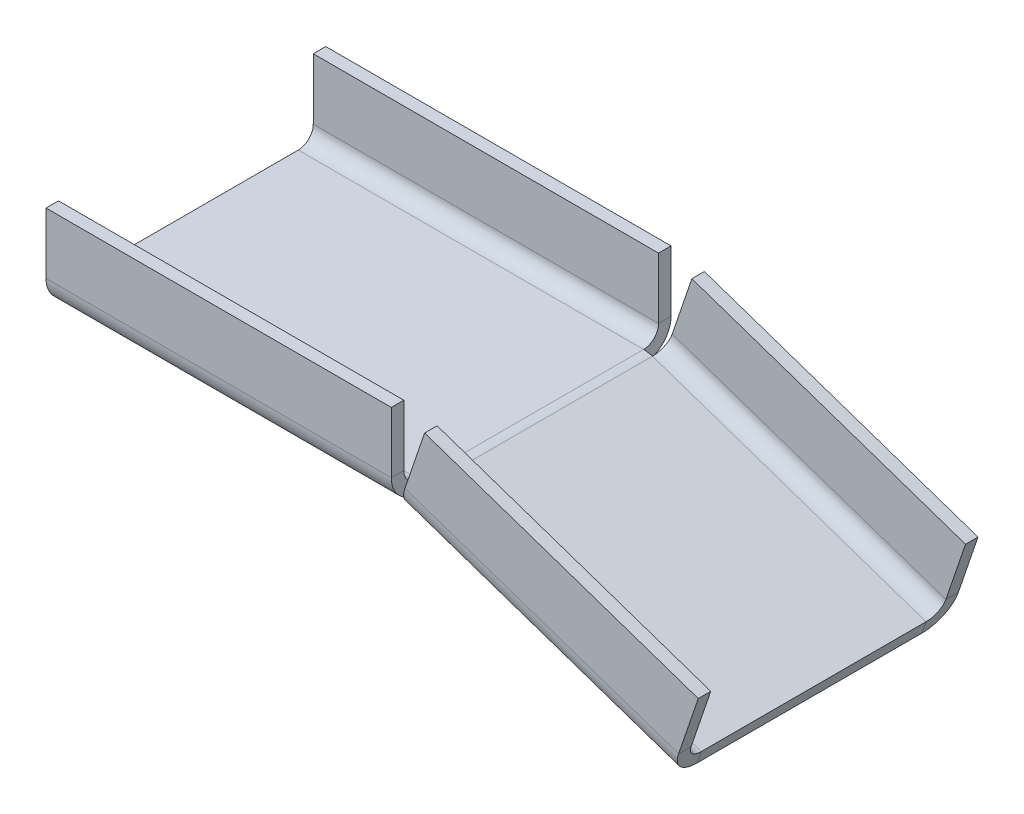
ISO-10303-21;
HEADER;
FILE_DESCRIPTION(('STEP AP214'),'2;1');
FILE_NAME('part.step','',(''),(''),'','','');
FILE_SCHEMA(('AUTOMOTIVE_DESIGN { 1 0 10303 214 1 1 1 1 }'));
ENDSEC;
DATA;
#1=APPLICATION_CONTEXT('core data for automotive mechanical design processes');
#2=APPLICATION_PROTOCOL_DEFINITION('international standard','automotive_design',2000,#1);
#3=PRODUCT_CONTEXT('',#1,'mechanical');
#4=PRODUCT('Part','Part','',(#3));
#5=PRODUCT_RELATED_PRODUCT_CATEGORY('part','',(#4));
#6=PRODUCT_DEFINITION_FORMATION('','',#4);
#7=PRODUCT_DEFINITION_CONTEXT('part definition',#1,'design');
#8=PRODUCT_DEFINITION('design','',#6,#7);
#9=PRODUCT_DEFINITION_SHAPE('','',#8);
#10=(LENGTH_UNIT() NAMED_UNIT(*) SI_UNIT(.MILLI.,.METRE.));
#11=(NAMED_UNIT(*) PLANE_ANGLE_UNIT() SI_UNIT($,.RADIAN.));
#12=(NAMED_UNIT(*) SI_UNIT($,.STERADIAN.) SOLID_ANGLE_UNIT());
#13=UNCERTAINTY_MEASURE_WITH_UNIT(LENGTH_MEASURE(1.E-05),#10,'distance_accuracy_value','');
#14=(GEOMETRIC_REPRESENTATION_CONTEXT(3) GLOBAL_UNCERTAINTY_ASSIGNED_CONTEXT((#13)) GLOBAL_UNIT_ASSIGNED_CONTEXT((#10,
#11,#12)) REPRESENTATION_CONTEXT('',''));
#15=CARTESIAN_POINT('',(0.,0.,0.));
#16=DIRECTION('',(0.,0.,1.));
#17=DIRECTION('',(1.,0.,0.));
#18=AXIS2_PLACEMENT_3D('',#15,#16,#17);
#19=CARTESIAN_POINT('',(1.72352764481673,-0.586592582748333,45.));
#20=DIRECTION('',(0.,0.,1.));
#21=DIRECTION('',(1.,0.,0.));
#22=AXIS2_PLACEMENT_3D('',#19,#20,#21);
#23=PLANE('',#22);
#24=DIRECTION('',(-0.322194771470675,-0.946673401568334,0.));
#25=VECTOR('',#24,1.);
#26=CARTESIAN_POINT('',(1.72352764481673,-0.586592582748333,45.));
#27=LINE('',#26,#25);
#28=CARTESIAN_POINT('',(1.72352764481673,-0.586592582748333,45.));
#29=VERTEX_POINT('',#28);
#30=CARTESIAN_POINT('',(0.112553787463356,-5.31995959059,45.));
#31=VERTEX_POINT('',#30);
#32=EDGE_CURVE('E11',#29,#31,#27,.T.);
#33=ORIENTED_EDGE('',*,*,#32,.F.);
#34=CARTESIAN_POINT('',(-1.8206148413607,-11.,45.));
#35=DIRECTION('',(0.,0.,1.));
#36=DIRECTION('',(1.,0.,0.));
#37=AXIS2_PLACEMENT_3D('',#34,#35,#36);
#38=CIRCLE('',#37,11.);
#39=CARTESIAN_POINT('',(-1.8206148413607,0.,45.));
#40=VERTEX_POINT('',#39);
#41=EDGE_CURVE('E398',#40,#29,#38,.F.);
#42=ORIENTED_EDGE('',*,*,#41,.F.);
#43=DIRECTION('',(0.,1.,0.));
#44=VECTOR('',#43,1.);
#45=CARTESIAN_POINT('',(-1.8206148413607,-5.,45.));
#46=LINE('',#45,#44);
#47=CARTESIAN_POINT('',(-1.82061484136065,-5.,45.));
#48=VERTEX_POINT('',#47);
#49=EDGE_CURVE('E40',#48,#40,#46,.T.);
#50=ORIENTED_EDGE('',*,*,#49,.F.);
#51=CARTESIAN_POINT('',(-1.8206148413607,-11.,45.));
#52=DIRECTION('',(0.,0.,1.));
#53=DIRECTION('',(1.,0.,0.));
#54=AXIS2_PLACEMENT_3D('',#51,#52,#53);
#55=CIRCLE('',#54,6.);
#56=EDGE_CURVE('E409',#48,#31,#55,.F.);
#57=ORIENTED_EDGE('',*,*,#56,.T.);
#58=EDGE_LOOP('',(#33,#42,#50,#57));
#59=FACE_BOUND('',#58,.T.);
#60=ADVANCED_FACE('F33',(#59),#23,.T.);
#61=CARTESIAN_POINT('',(-1.8206148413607,0.,-45.));
#62=DIRECTION('',(0.,0.,-1.));
#63=DIRECTION('',(-1.,0.,0.));
#64=AXIS2_PLACEMENT_3D('',#61,#62,#63);
#65=PLANE('',#64);
#66=DIRECTION('',(0.,-1.,0.));
#67=VECTOR('',#66,1.);
#68=CARTESIAN_POINT('',(-1.8206148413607,0.,-45.));
#69=LINE('',#68,#67);
#70=CARTESIAN_POINT('',(-1.82061484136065,0.,-45.));
#71=VERTEX_POINT('',#70);
#72=CARTESIAN_POINT('',(-1.8206148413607,-5.,-45.));
#73=VERTEX_POINT('',#72);
#74=EDGE_CURVE('E435',#71,#73,#69,.T.);
#75=ORIENTED_EDGE('',*,*,#74,.F.);
#76=CARTESIAN_POINT('',(-1.8206148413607,-11.,-45.));
#77=DIRECTION('',(0.,0.,1.));
#78=DIRECTION('',(1.,0.,0.));
#79=AXIS2_PLACEMENT_3D('',#76,#77,#78);
#80=CIRCLE('',#79,11.);
#81=CARTESIAN_POINT('',(1.72352764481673,-0.586592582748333,-45.));
#82=VERTEX_POINT('',#81);
#83=EDGE_CURVE('E375',#71,#82,#80,.F.);
#84=ORIENTED_EDGE('',*,*,#83,.T.);
#85=DIRECTION('',(0.322194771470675,0.946673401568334,0.));
#86=VECTOR('',#85,1.);
#87=CARTESIAN_POINT('',(0.112553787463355,-5.31995959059,-45.));
#88=LINE('',#87,#86);
#89=CARTESIAN_POINT('',(0.112553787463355,-5.31995959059,-45.));
#90=VERTEX_POINT('',#89);
#91=EDGE_CURVE('E201',#90,#82,#88,.T.);
#92=ORIENTED_EDGE('',*,*,#91,.F.);
#93=CARTESIAN_POINT('',(-1.8206148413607,-11.,-45.));
#94=DIRECTION('',(0.,0.,1.));
#95=DIRECTION('',(1.,0.,0.));
#96=AXIS2_PLACEMENT_3D('',#93,#94,#95);
#97=CIRCLE('',#96,6.);
#98=EDGE_CURVE('E387',#73,#90,#97,.F.);
#99=ORIENTED_EDGE('',*,*,#98,.F.);
#100=EDGE_LOOP('',(#75,#84,#92,#99));
#101=FACE_BOUND('',#100,.T.);
#102=ADVANCED_FACE('F489',(#101),#65,.T.);
#103=CARTESIAN_POINT('',(-1.61097385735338,-4.73336700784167,45.));
#104=DIRECTION('',(0.322194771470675,0.946673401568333,0.));
#105=DIRECTION('',(-0.946673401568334,0.322194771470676,0.));
#106=AXIS2_PLACEMENT_3D('',#103,#104,#105);
#107=PLANE('',#106);
#108=DIRECTION('',(0.946673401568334,-0.322194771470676,0.));
#109=VECTOR('',#108,1.);
#110=CARTESIAN_POINT('',(-1.61097385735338,-4.73336700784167,-45.));
#111=LINE('',#110,#109);
#112=CARTESIAN_POINT('',(109.673244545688,-42.6083017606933,-45.));
#113=VERTEX_POINT('',#112);
#114=EDGE_CURVE('E365',#90,#113,#111,.T.);
#115=ORIENTED_EDGE('',*,*,#114,.T.);
#116=DIRECTION('',(0.,0.,-1.));
#117=VECTOR('',#116,1.);
#118=CARTESIAN_POINT('',(109.673244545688,-42.6083017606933,45.));
#119=LINE('',#118,#117);
#120=CARTESIAN_POINT('',(109.673244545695,-42.6083017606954,45.));
#121=VERTEX_POINT('',#120);
#122=EDGE_CURVE('E432',#121,#113,#119,.T.);
#123=ORIENTED_EDGE('',*,*,#122,.F.);
#124=DIRECTION('',(0.946673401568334,-0.322194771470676,0.));
#125=VECTOR('',#124,1.);
#126=CARTESIAN_POINT('',(-1.61097385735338,-4.73336700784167,45.));
#127=LINE('',#126,#125);
#128=EDGE_CURVE('E390',#31,#121,#127,.T.);
#129=ORIENTED_EDGE('',*,*,#128,.F.);
#130=DIRECTION('',(0.,0.,-1.));
#131=VECTOR('',#130,1.);
#132=CARTESIAN_POINT('',(0.112553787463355,-5.31995959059,45.));
#133=LINE('',#132,#131);
#134=EDGE_CURVE('E412',#31,#90,#133,.T.);
#135=ORIENTED_EDGE('',*,*,#134,.T.);
#136=EDGE_LOOP('',(#115,#123,#129,#135));
#137=FACE_BOUND('',#136,.T.);
#138=ADVANCED_FACE('F493',(#137),#107,.F.);
#139=CARTESIAN_POINT('',(111.284218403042,-37.8749347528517,45.));
#140=DIRECTION('',(0.946673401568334,-0.322194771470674,0.));
#141=DIRECTION('',(0.322194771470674,0.946673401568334,0.));
#142=AXIS2_PLACEMENT_3D('',#139,#140,#141);
#143=PLANE('',#142);
#144=DIRECTION('',(-0.322194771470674,-0.946673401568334,0.));
#145=VECTOR('',#144,1.);
#146=CARTESIAN_POINT('',(111.284218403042,-37.8749347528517,-45.));
#147=LINE('',#146,#145);
#148=CARTESIAN_POINT('',(111.284218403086,-37.8749347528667,-45.));
#149=VERTEX_POINT('',#148);
#150=EDGE_CURVE('E370',#149,#113,#147,.T.);
#151=ORIENTED_EDGE('',*,*,#150,.F.);
#152=DIRECTION('',(0.,0.,-1.));
#153=VECTOR('',#152,1.);
#154=CARTESIAN_POINT('',(111.284218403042,-37.8749347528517,45.));
#155=LINE('',#154,#153);
#156=CARTESIAN_POINT('',(111.284218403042,-37.8749347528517,45.));
#157=VERTEX_POINT('',#156);
#158=EDGE_CURVE('E429',#157,#149,#155,.T.);
#159=ORIENTED_EDGE('',*,*,#158,.F.);
#160=DIRECTION('',(-0.322194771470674,-0.946673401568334,0.));
#161=VECTOR('',#160,1.);
#162=CARTESIAN_POINT('',(111.284218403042,-37.8749347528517,45.));
#163=LINE('',#162,#161);
#164=EDGE_CURVE('E392',#157,#121,#163,.T.);
#165=ORIENTED_EDGE('',*,*,#164,.T.);
#166=ORIENTED_EDGE('',*,*,#122,.T.);
#167=EDGE_LOOP('',(#151,#159,#165,#166));
#168=FACE_BOUND('',#167,.T.);
#169=ADVANCED_FACE('F498',(#168),#143,.T.);
#170=CARTESIAN_POINT('',(0.,0.,45.));
#171=DIRECTION('',(0.322194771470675,0.946673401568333,0.));
#172=DIRECTION('',(-0.946673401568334,0.322194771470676,0.));
#173=AXIS2_PLACEMENT_3D('',#170,#171,#172);
#174=PLANE('',#173);
#175=DIRECTION('',(0.946673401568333,-0.322194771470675,0.));
#176=VECTOR('',#175,1.);
#177=CARTESIAN_POINT('',(0.,0.,-45.));
#178=LINE('',#177,#176);
#179=EDGE_CURVE('E373',#82,#149,#178,.T.);
#180=ORIENTED_EDGE('',*,*,#179,.F.);
#181=DIRECTION('',(0.,0.,-1.));
#182=VECTOR('',#181,1.);
#183=CARTESIAN_POINT('',(1.72352764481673,-0.586592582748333,45.));
#184=LINE('',#183,#182);
#185=EDGE_CURVE('E427',#29,#82,#184,.T.);
#186=ORIENTED_EDGE('',*,*,#185,.F.);
#187=DIRECTION('',(0.946673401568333,-0.322194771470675,0.));
#188=VECTOR('',#187,1.);
#189=CARTESIAN_POINT('',(0.,0.,45.));
#190=LINE('',#189,#188);
#191=EDGE_CURVE('E395',#29,#157,#190,.T.);
#192=ORIENTED_EDGE('',*,*,#191,.T.);
#193=ORIENTED_EDGE('',*,*,#158,.T.);
#194=EDGE_LOOP('',(#180,#186,#192,#193));
#195=FACE_BOUND('',#194,.T.);
#196=ADVANCED_FACE('F505',(#195),#174,.T.);
#197=CARTESIAN_POINT('',(-1.8206148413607,-11.,45.));
#198=DIRECTION('',(0.,0.,-1.));
#199=DIRECTION('',(-1.,0.,0.));
#200=AXIS2_PLACEMENT_3D('',#197,#198,#199);
#201=CYLINDRICAL_SURFACE('',#200,11.);
#202=ORIENTED_EDGE('',*,*,#83,.F.);
#203=DIRECTION('',(0.,0.,-1.));
#204=VECTOR('',#203,1.);
#205=CARTESIAN_POINT('',(-1.8206148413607,0.,45.));
#206=LINE('',#205,#204);
#207=EDGE_CURVE('E424',#40,#71,#206,.T.);
#208=ORIENTED_EDGE('',*,*,#207,.F.);
#209=ORIENTED_EDGE('',*,*,#41,.T.);
#210=ORIENTED_EDGE('',*,*,#185,.T.);
#211=EDGE_LOOP('',(#202,#208,#209,#210));
#212=FACE_BOUND('',#211,.T.);
#213=ADVANCED_FACE('F447',(#212),#201,.T.);
#214=CARTESIAN_POINT('',(0.,0.,45.));
#215=DIRECTION('',(0.,1.,0.));
#216=DIRECTION('',(0.,0.,1.));
#217=AXIS2_PLACEMENT_3D('',#214,#215,#216);
#218=PLANE('',#217);
#219=DIRECTION('',(1.,0.,0.));
#220=VECTOR('',#219,1.);
#221=CARTESIAN_POINT('',(0.,0.,-45.));
#222=LINE('',#221,#220);
#223=CARTESIAN_POINT('',(-140.068203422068,0.,-45.));
#224=VERTEX_POINT('',#223);
#225=EDGE_CURVE('E378',#224,#71,#222,.T.);
#226=ORIENTED_EDGE('',*,*,#225,.F.);
#227=DIRECTION('',(0.,0.,-1.));
#228=VECTOR('',#227,1.);
#229=CARTESIAN_POINT('',(-140.068203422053,0.,45.));
#230=LINE('',#229,#228);
#231=CARTESIAN_POINT('',(-140.068203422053,0.,45.));
#232=VERTEX_POINT('',#231);
#233=EDGE_CURVE('E421',#232,#224,#230,.T.);
#234=ORIENTED_EDGE('',*,*,#233,.F.);
#235=DIRECTION('',(1.,0.,0.));
#236=VECTOR('',#235,1.);
#237=CARTESIAN_POINT('',(0.,0.,45.));
#238=LINE('',#237,#236);
#239=EDGE_CURVE('E401',#232,#40,#238,.T.);
#240=ORIENTED_EDGE('',*,*,#239,.T.);
#241=ORIENTED_EDGE('',*,*,#207,.T.);
#242=EDGE_LOOP('',(#226,#234,#240,#241));
#243=FACE_BOUND('',#242,.T.);
#244=ADVANCED_FACE('F453',(#243),#218,.T.);
#245=CARTESIAN_POINT('',(-140.068203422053,-5.,45.));
#246=DIRECTION('',(-1.,0.,0.));
#247=DIRECTION('',(0.,0.,1.));
#248=AXIS2_PLACEMENT_3D('',#245,#246,#247);
#249=PLANE('',#248);
#250=DIRECTION('',(0.,1.,0.));
#251=VECTOR('',#250,1.);
#252=CARTESIAN_POINT('',(-140.068203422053,-5.,-45.));
#253=LINE('',#252,#251);
#254=CARTESIAN_POINT('',(-140.068203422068,-5.,-45.));
#255=VERTEX_POINT('',#254);
#256=EDGE_CURVE('E381',#255,#224,#253,.T.);
#257=ORIENTED_EDGE('',*,*,#256,.F.);
#258=DIRECTION('',(0.,0.,-1.));
#259=VECTOR('',#258,1.);
#260=CARTESIAN_POINT('',(-140.068203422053,-5.,45.));
#261=LINE('',#260,#259);
#262=CARTESIAN_POINT('',(-140.068203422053,-5.,45.));
#263=VERTEX_POINT('',#262);
#264=EDGE_CURVE('E418',#263,#255,#261,.T.);
#265=ORIENTED_EDGE('',*,*,#264,.F.);
#266=DIRECTION('',(0.,1.,0.));
#267=VECTOR('',#266,1.);
#268=CARTESIAN_POINT('',(-140.068203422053,-5.,45.));
#269=LINE('',#268,#267);
#270=EDGE_CURVE('E404',#263,#232,#269,.T.);
#271=ORIENTED_EDGE('',*,*,#270,.T.);
#272=ORIENTED_EDGE('',*,*,#233,.T.);
#273=EDGE_LOOP('',(#257,#265,#271,#272));
#274=FACE_BOUND('',#273,.T.);
#275=ADVANCED_FACE('F514',(#274),#249,.T.);
#276=CARTESIAN_POINT('',(0.,-5.,45.));
#277=DIRECTION('',(0.,1.,0.));
#278=DIRECTION('',(0.,0.,1.));
#279=AXIS2_PLACEMENT_3D('',#276,#277,#278);
#280=PLANE('',#279);
#281=DIRECTION('',(1.,0.,0.));
#282=VECTOR('',#281,1.);
#283=CARTESIAN_POINT('',(0.,-5.,-45.));
#284=LINE('',#283,#282);
#285=EDGE_CURVE('E384',#255,#73,#284,.T.);
#286=ORIENTED_EDGE('',*,*,#285,.T.);
#287=DIRECTION('',(0.,0.,-1.));
#288=VECTOR('',#287,1.);
#289=CARTESIAN_POINT('',(-1.8206148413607,-5.,45.));
#290=LINE('',#289,#288);
#291=EDGE_CURVE('E415',#48,#73,#290,.T.);
#292=ORIENTED_EDGE('',*,*,#291,.F.);
#293=DIRECTION('',(1.,0.,0.));
#294=VECTOR('',#293,1.);
#295=CARTESIAN_POINT('',(0.,-5.,45.));
#296=LINE('',#295,#294);
#297=EDGE_CURVE('E407',#263,#48,#296,.T.);
#298=ORIENTED_EDGE('',*,*,#297,.F.);
#299=ORIENTED_EDGE('',*,*,#264,.T.);
#300=EDGE_LOOP('',(#286,#292,#298,#299));
#301=FACE_BOUND('',#300,.T.);
#302=ADVANCED_FACE('F517',(#301),#280,.F.);
#303=CARTESIAN_POINT('',(-1.8206148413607,-11.,45.));
#304=DIRECTION('',(0.,0.,-1.));
#305=DIRECTION('',(-1.,0.,0.));
#306=AXIS2_PLACEMENT_3D('',#303,#304,#305);
#307=CYLINDRICAL_SURFACE('',#306,6.);
#308=ORIENTED_EDGE('',*,*,#98,.T.);
#309=ORIENTED_EDGE('',*,*,#134,.F.);
#310=ORIENTED_EDGE('',*,*,#56,.F.);
#311=ORIENTED_EDGE('',*,*,#291,.T.);
#312=EDGE_LOOP('',(#308,#309,#310,#311));
#313=FACE_BOUND('',#312,.T.);
#314=ADVANCED_FACE('F520',(#313),#307,.F.);
#315=CARTESIAN_POINT('',(-140.068203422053,30.3991962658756,51.));
#316=DIRECTION('',(0.,-1.,0.));
#317=DIRECTION('',(1.,0.,0.));
#318=AXIS2_PLACEMENT_3D('',#315,#316,#317);
#319=PLANE('',#318);
#320=DIRECTION('',(0.,0.,1.));
#321=VECTOR('',#320,1.);
#322=CARTESIAN_POINT('',(-1.8206148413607,30.3991962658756,51.));
#323=LINE('',#322,#321);
#324=CARTESIAN_POINT('',(-1.8206148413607,30.3991962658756,51.));
#325=VERTEX_POINT('',#324);
#326=CARTESIAN_POINT('',(-1.8206148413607,30.3991962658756,56.));
#327=VERTEX_POINT('',#326);
#328=EDGE_CURVE('E363',#325,#327,#323,.T.);
#329=ORIENTED_EDGE('',*,*,#328,.F.);
#330=DIRECTION('',(1.,0.,0.));
#331=VECTOR('',#330,1.);
#332=CARTESIAN_POINT('',(-140.068203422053,30.3991962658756,51.));
#333=LINE('',#332,#331);
#334=CARTESIAN_POINT('',(-140.068203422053,30.3991962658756,51.));
#335=VERTEX_POINT('',#334);
#336=EDGE_CURVE('E334',#335,#325,#333,.T.);
#337=ORIENTED_EDGE('',*,*,#336,.F.);
#338=DIRECTION('',(0.,0.,1.));
#339=VECTOR('',#338,1.);
#340=CARTESIAN_POINT('',(-140.068203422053,30.3991962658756,51.));
#341=LINE('',#340,#339);
#342=CARTESIAN_POINT('',(-140.068203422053,30.3991962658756,56.));
#343=VERTEX_POINT('',#342);
#344=EDGE_CURVE('E361',#335,#343,#341,.T.);
#345=ORIENTED_EDGE('',*,*,#344,.T.);
#346=DIRECTION('',(1.,0.,0.));
#347=VECTOR('',#346,1.);
#348=CARTESIAN_POINT('',(-140.068203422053,30.3991962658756,56.));
#349=LINE('',#348,#347);
#350=EDGE_CURVE('E345',#343,#327,#349,.T.);
#351=ORIENTED_EDGE('',*,*,#350,.T.);
#352=EDGE_LOOP('',(#329,#337,#345,#351));
#353=FACE_BOUND('',#352,.T.);
#354=ADVANCED_FACE('F469',(#353),#319,.F.);
#355=CARTESIAN_POINT('',(-140.068203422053,30.3991962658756,51.));
#356=DIRECTION('',(1.,0.,0.));
#357=DIRECTION('',(0.,1.,0.));
#358=AXIS2_PLACEMENT_3D('',#355,#356,#357);
#359=PLANE('',#358);
#360=ORIENTED_EDGE('',*,*,#344,.F.);
#361=DIRECTION('',(0.,1.,0.));
#362=VECTOR('',#361,1.);
#363=CARTESIAN_POINT('',(-140.068203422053,30.3991962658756,51.));
#364=LINE('',#363,#362);
#365=CARTESIAN_POINT('',(-140.068203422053,6.,51.));
#366=VERTEX_POINT('',#365);
#367=EDGE_CURVE('E338',#335,#366,#364,.F.);
#368=ORIENTED_EDGE('',*,*,#367,.T.);
#369=DIRECTION('',(0.,0.,1.));
#370=VECTOR('',#369,1.);
#371=CARTESIAN_POINT('',(-140.068203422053,6.,51.));
#372=LINE('',#371,#370);
#373=CARTESIAN_POINT('',(-140.068203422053,6.,56.));
#374=VERTEX_POINT('',#373);
#375=EDGE_CURVE('E358',#366,#374,#372,.T.);
#376=ORIENTED_EDGE('',*,*,#375,.T.);
#377=DIRECTION('',(0.,1.,0.));
#378=VECTOR('',#377,1.);
#379=CARTESIAN_POINT('',(-140.068203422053,30.3991962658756,56.));
#380=LINE('',#379,#378);
#381=EDGE_CURVE('E350',#343,#374,#380,.F.);
#382=ORIENTED_EDGE('',*,*,#381,.F.);
#383=EDGE_LOOP('',(#360,#368,#376,#382));
#384=FACE_BOUND('',#383,.T.);
#385=ADVANCED_FACE('F462',(#384),#359,.F.);
#386=CARTESIAN_POINT('',(-1.8206148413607,30.3991962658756,51.));
#387=DIRECTION('',(1.,0.,0.));
#388=DIRECTION('',(0.,1.,0.));
#389=AXIS2_PLACEMENT_3D('',#386,#387,#388);
#390=PLANE('',#389);
#391=DIRECTION('',(0.,1.,0.));
#392=VECTOR('',#391,1.);
#393=CARTESIAN_POINT('',(-1.8206148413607,30.3991962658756,51.));
#394=LINE('',#393,#392);
#395=CARTESIAN_POINT('',(-1.82061484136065,6.,51.));
#396=VERTEX_POINT('',#395);
#397=EDGE_CURVE('E337',#396,#325,#394,.T.);
#398=ORIENTED_EDGE('',*,*,#397,.T.);
#399=ORIENTED_EDGE('',*,*,#328,.T.);
#400=DIRECTION('',(0.,1.,0.));
#401=VECTOR('',#400,1.);
#402=CARTESIAN_POINT('',(-1.8206148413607,30.3991962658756,56.));
#403=LINE('',#402,#401);
#404=CARTESIAN_POINT('',(-1.8206148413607,6.,56.));
#405=VERTEX_POINT('',#404);
#406=EDGE_CURVE('E349',#405,#327,#403,.T.);
#407=ORIENTED_EDGE('',*,*,#406,.F.);
#408=DIRECTION('',(0.,0.,1.));
#409=VECTOR('',#408,1.);
#410=CARTESIAN_POINT('',(-1.8206148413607,6.,51.));
#411=LINE('',#410,#409);
#412=EDGE_CURVE('E357',#396,#405,#411,.T.);
#413=ORIENTED_EDGE('',*,*,#412,.F.);
#414=EDGE_LOOP('',(#398,#399,#407,#413));
#415=FACE_BOUND('',#414,.T.);
#416=ADVANCED_FACE('F475',(#415),#390,.T.);
#417=CARTESIAN_POINT('',(-140.068203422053,30.3991962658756,56.));
#418=DIRECTION('',(0.,0.,1.));
#419=DIRECTION('',(1.,0.,0.));
#420=AXIS2_PLACEMENT_3D('',#417,#418,#419);
#421=PLANE('',#420);
#422=DIRECTION('',(1.,0.,0.));
#423=VECTOR('',#422,1.);
#424=CARTESIAN_POINT('',(-140.068203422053,6.,56.));
#425=LINE('',#424,#423);
#426=EDGE_CURVE('E346',#374,#405,#425,.T.);
#427=ORIENTED_EDGE('',*,*,#426,.T.);
#428=ORIENTED_EDGE('',*,*,#406,.T.);
#429=ORIENTED_EDGE('',*,*,#350,.F.);
#430=ORIENTED_EDGE('',*,*,#381,.T.);
#431=EDGE_LOOP('',(#427,#428,#429,#430));
#432=FACE_BOUND('',#431,.T.);
#433=ADVANCED_FACE('F466',(#432),#421,.T.);
#434=CARTESIAN_POINT('',(-140.068203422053,30.3991962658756,51.));
#435=DIRECTION('',(0.,0.,1.));
#436=DIRECTION('',(1.,0.,0.));
#437=AXIS2_PLACEMENT_3D('',#434,#435,#436);
#438=PLANE('',#437);
#439=DIRECTION('',(1.,0.,0.));
#440=VECTOR('',#439,1.);
#441=CARTESIAN_POINT('',(-140.068203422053,6.,51.));
#442=LINE('',#441,#440);
#443=EDGE_CURVE('E335',#366,#396,#442,.T.);
#444=ORIENTED_EDGE('',*,*,#443,.F.);
#445=ORIENTED_EDGE('',*,*,#367,.F.);
#446=ORIENTED_EDGE('',*,*,#336,.T.);
#447=ORIENTED_EDGE('',*,*,#397,.F.);
#448=EDGE_LOOP('',(#444,#445,#446,#447));
#449=FACE_BOUND('',#448,.T.);
#450=ADVANCED_FACE('F472',(#449),#438,.F.);
#451=CARTESIAN_POINT('',(-1.82061484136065,6.,45.));
#452=DIRECTION('',(-1.,0.,0.));
#453=DIRECTION('',(0.,0.,1.));
#454=AXIS2_PLACEMENT_3D('',#451,#452,#453);
#455=PLANE('',#454);
#456=ORIENTED_EDGE('',*,*,#49,.T.);
#457=CARTESIAN_POINT('',(-1.82061484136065,6.,45.));
#458=DIRECTION('',(1.,0.,0.));
#459=DIRECTION('',(0.,0.,-1.));
#460=AXIS2_PLACEMENT_3D('',#457,#458,#459);
#461=CIRCLE('',#460,6.);
#462=EDGE_CURVE('E47',#40,#396,#461,.F.);
#463=ORIENTED_EDGE('',*,*,#462,.T.);
#464=ORIENTED_EDGE('',*,*,#412,.T.);
#465=CARTESIAN_POINT('',(-1.82061484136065,6.,45.));
#466=DIRECTION('',(1.,0.,0.));
#467=DIRECTION('',(0.,0.,-1.));
#468=AXIS2_PLACEMENT_3D('',#465,#466,#467);
#469=CIRCLE('',#468,11.);
#470=EDGE_CURVE('E329',#48,#405,#469,.F.);
#471=ORIENTED_EDGE('',*,*,#470,.F.);
#472=EDGE_LOOP('',(#456,#463,#464,#471));
#473=FACE_BOUND('',#472,.T.);
#474=ADVANCED_FACE('F440',(#473),#455,.F.);
#475=CARTESIAN_POINT('',(-140.068203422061,6.,45.));
#476=DIRECTION('',(1.,0.,-1.26735594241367E-12));
#477=DIRECTION('',(-1.26735594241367E-12,0.,-1.));
#478=AXIS2_PLACEMENT_3D('',#475,#476,#477);
#479=PLANE('',#478);
#480=CARTESIAN_POINT('',(-140.068203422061,6.,45.));
#481=DIRECTION('',(-1.,0.,1.26735594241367E-12));
#482=DIRECTION('',(1.26735594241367E-12,0.,1.));
#483=AXIS2_PLACEMENT_3D('',#480,#481,#482);
#484=CIRCLE('',#483,6.);
#485=EDGE_CURVE('E326',#366,#232,#484,.F.);
#486=ORIENTED_EDGE('',*,*,#485,.T.);
#487=ORIENTED_EDGE('',*,*,#270,.F.);
#488=CARTESIAN_POINT('',(-140.068203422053,6.,45.));
#489=DIRECTION('',(1.,0.,0.));
#490=DIRECTION('',(0.,0.,-1.));
#491=AXIS2_PLACEMENT_3D('',#488,#489,#490);
#492=CIRCLE('',#491,11.);
#493=EDGE_CURVE('E331',#374,#263,#492,.T.);
#494=ORIENTED_EDGE('',*,*,#493,.F.);
#495=ORIENTED_EDGE('',*,*,#375,.F.);
#496=EDGE_LOOP('',(#486,#487,#494,#495));
#497=FACE_BOUND('',#496,.T.);
#498=ADVANCED_FACE('F458',(#497),#479,.F.);
#499=CARTESIAN_POINT('',(-831.306146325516,6.,45.));
#500=DIRECTION('',(1.,0.,0.));
#501=DIRECTION('',(0.,0.,-1.));
#502=AXIS2_PLACEMENT_3D('',#499,#500,#501);
#503=CYLINDRICAL_SURFACE('',#502,11.);
#504=ORIENTED_EDGE('',*,*,#426,.F.);
#505=ORIENTED_EDGE('',*,*,#493,.T.);
#506=ORIENTED_EDGE('',*,*,#297,.T.);
#507=ORIENTED_EDGE('',*,*,#470,.T.);
#508=EDGE_LOOP('',(#504,#505,#506,#507));
#509=FACE_BOUND('',#508,.T.);
#510=ADVANCED_FACE('F597',(#509),#503,.T.);
#511=CARTESIAN_POINT('',(-831.306146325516,6.,45.));
#512=DIRECTION('',(1.,0.,0.));
#513=DIRECTION('',(0.,0.,-1.));
#514=AXIS2_PLACEMENT_3D('',#511,#512,#513);
#515=CYLINDRICAL_SURFACE('',#514,6.);
#516=ORIENTED_EDGE('',*,*,#443,.T.);
#517=ORIENTED_EDGE('',*,*,#462,.F.);
#518=ORIENTED_EDGE('',*,*,#239,.F.);
#519=ORIENTED_EDGE('',*,*,#485,.F.);
#520=EDGE_LOOP('',(#516,#517,#518,#519));
#521=FACE_BOUND('',#520,.T.);
#522=ADVANCED_FACE('F455',(#521),#515,.F.);
#523=CARTESIAN_POINT('',(11.5179897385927,28.1915179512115,51.));
#524=DIRECTION('',(-0.322194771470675,-0.946673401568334,0.));
#525=DIRECTION('',(0.946673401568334,-0.322194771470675,0.));
#526=AXIS2_PLACEMENT_3D('',#523,#524,#525);
#527=PLANE('',#526);
#528=DIRECTION('',(0.,0.,1.));
#529=VECTOR('',#528,1.);
#530=CARTESIAN_POINT('',(121.078680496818,-9.09682421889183,51.));
#531=LINE('',#530,#529);
#532=CARTESIAN_POINT('',(121.078680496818,-9.09682421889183,51.));
#533=VERTEX_POINT('',#532);
#534=CARTESIAN_POINT('',(121.078680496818,-9.09682421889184,56.));
#535=VERTEX_POINT('',#534);
#536=EDGE_CURVE('E321',#533,#535,#531,.T.);
#537=ORIENTED_EDGE('',*,*,#536,.F.);
#538=DIRECTION('',(0.946673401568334,-0.322194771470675,0.));
#539=VECTOR('',#538,1.);
#540=CARTESIAN_POINT('',(11.5179897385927,28.1915179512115,51.));
#541=LINE('',#540,#539);
#542=CARTESIAN_POINT('',(11.5179897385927,28.1915179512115,51.));
#543=VERTEX_POINT('',#542);
#544=EDGE_CURVE('E294',#543,#533,#541,.T.);
#545=ORIENTED_EDGE('',*,*,#544,.F.);
#546=DIRECTION('',(0.,0.,1.));
#547=VECTOR('',#546,1.);
#548=CARTESIAN_POINT('',(11.5179897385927,28.1915179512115,51.));
#549=LINE('',#548,#547);
#550=CARTESIAN_POINT('',(11.5179897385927,28.1915179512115,56.));
#551=VERTEX_POINT('',#550);
#552=EDGE_CURVE('E319',#543,#551,#549,.T.);
#553=ORIENTED_EDGE('',*,*,#552,.T.);
#554=DIRECTION('',(0.946673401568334,-0.322194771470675,0.));
#555=VECTOR('',#554,1.);
#556=CARTESIAN_POINT('',(11.5179897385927,28.1915179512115,56.));
#557=LINE('',#556,#555);
#558=EDGE_CURVE('E305',#551,#535,#557,.T.);
#559=ORIENTED_EDGE('',*,*,#558,.T.);
#560=EDGE_LOOP('',(#537,#545,#553,#559));
#561=FACE_BOUND('',#560,.T.);
#562=ADVANCED_FACE('F589',(#561),#527,.F.);
#563=CARTESIAN_POINT('',(11.5179897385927,28.1915179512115,51.));
#564=DIRECTION('',(0.946673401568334,-0.322194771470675,0.));
#565=DIRECTION('',(0.322194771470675,0.946673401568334,0.));
#566=AXIS2_PLACEMENT_3D('',#563,#564,#565);
#567=PLANE('',#566);
#568=ORIENTED_EDGE('',*,*,#552,.F.);
#569=DIRECTION('',(0.322194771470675,0.946673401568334,0.));
#570=VECTOR('',#569,1.);
#571=CARTESIAN_POINT('',(11.5179897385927,28.1915179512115,51.));
#572=LINE('',#571,#570);
#573=CARTESIAN_POINT('',(3.65669627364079,5.09344782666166,51.));
#574=VERTEX_POINT('',#573);
#575=EDGE_CURVE('E298',#543,#574,#572,.F.);
#576=ORIENTED_EDGE('',*,*,#575,.T.);
#577=DIRECTION('',(0.,0.,1.));
#578=VECTOR('',#577,1.);
#579=CARTESIAN_POINT('',(3.65669627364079,5.09344782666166,51.));
#580=LINE('',#579,#578);
#581=CARTESIAN_POINT('',(3.65669627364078,5.09344782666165,56.));
#582=VERTEX_POINT('',#581);
#583=EDGE_CURVE('E317',#574,#582,#580,.T.);
#584=ORIENTED_EDGE('',*,*,#583,.T.);
#585=DIRECTION('',(0.322194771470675,0.946673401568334,0.));
#586=VECTOR('',#585,1.);
#587=CARTESIAN_POINT('',(11.5179897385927,28.1915179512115,56.));
#588=LINE('',#587,#586);
#589=EDGE_CURVE('E309',#551,#582,#588,.F.);
#590=ORIENTED_EDGE('',*,*,#589,.F.);
#591=EDGE_LOOP('',(#568,#576,#584,#590));
#592=FACE_BOUND('',#591,.T.);
#593=ADVANCED_FACE('F570',(#592),#567,.F.);
#594=CARTESIAN_POINT('',(121.078680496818,-9.09682421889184,51.));
#595=DIRECTION('',(0.946673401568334,-0.322194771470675,0.));
#596=DIRECTION('',(0.322194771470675,0.946673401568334,0.));
#597=AXIS2_PLACEMENT_3D('',#594,#595,#596);
#598=PLANE('',#597);
#599=DIRECTION('',(0.322194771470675,0.946673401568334,0.));
#600=VECTOR('',#599,1.);
#601=CARTESIAN_POINT('',(121.078680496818,-9.09682421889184,51.));
#602=LINE('',#601,#600);
#603=CARTESIAN_POINT('',(113.217387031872,-32.1948943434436,51.));
#604=VERTEX_POINT('',#603);
#605=EDGE_CURVE('E297',#604,#533,#602,.T.);
#606=ORIENTED_EDGE('',*,*,#605,.T.);
#607=ORIENTED_EDGE('',*,*,#536,.T.);
#608=DIRECTION('',(0.322194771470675,0.946673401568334,0.));
#609=VECTOR('',#608,1.);
#610=CARTESIAN_POINT('',(121.078680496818,-9.09682421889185,56.));
#611=LINE('',#610,#609);
#612=CARTESIAN_POINT('',(113.217387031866,-32.1948943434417,56.));
#613=VERTEX_POINT('',#612);
#614=EDGE_CURVE('E308',#613,#535,#611,.T.);
#615=ORIENTED_EDGE('',*,*,#614,.F.);
#616=DIRECTION('',(0.,0.,1.));
#617=VECTOR('',#616,1.);
#618=CARTESIAN_POINT('',(113.217387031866,-32.1948943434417,51.));
#619=LINE('',#618,#617);
#620=EDGE_CURVE('E316',#604,#613,#619,.T.);
#621=ORIENTED_EDGE('',*,*,#620,.F.);
#622=EDGE_LOOP('',(#606,#607,#615,#621));
#623=FACE_BOUND('',#622,.T.);
#624=ADVANCED_FACE('F584',(#623),#598,.T.);
#625=CARTESIAN_POINT('',(11.5179897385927,28.1915179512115,56.));
#626=DIRECTION('',(0.,0.,1.));
#627=DIRECTION('',(0.946673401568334,-0.322194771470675,0.));
#628=AXIS2_PLACEMENT_3D('',#625,#626,#627);
#629=PLANE('',#628);
#630=DIRECTION('',(0.946673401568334,-0.322194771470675,0.));
#631=VECTOR('',#630,1.);
#632=CARTESIAN_POINT('',(3.65669627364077,5.09344782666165,56.));
#633=LINE('',#632,#631);
#634=EDGE_CURVE('E306',#582,#613,#633,.T.);
#635=ORIENTED_EDGE('',*,*,#634,.T.);
#636=ORIENTED_EDGE('',*,*,#614,.T.);
#637=ORIENTED_EDGE('',*,*,#558,.F.);
#638=ORIENTED_EDGE('',*,*,#589,.T.);
#639=EDGE_LOOP('',(#635,#636,#637,#638));
#640=FACE_BOUND('',#639,.T.);
#641=ADVANCED_FACE('F575',(#640),#629,.T.);
#642=CARTESIAN_POINT('',(11.5179897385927,28.1915179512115,51.));
#643=DIRECTION('',(0.,0.,1.));
#644=DIRECTION('',(0.946673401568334,-0.322194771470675,0.));
#645=AXIS2_PLACEMENT_3D('',#642,#643,#644);
#646=PLANE('',#645);
#647=DIRECTION('',(0.946673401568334,-0.322194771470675,0.));
#648=VECTOR('',#647,1.);
#649=CARTESIAN_POINT('',(3.65669627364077,5.09344782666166,51.));
#650=LINE('',#649,#648);
#651=EDGE_CURVE('E295',#574,#604,#650,.T.);
#652=ORIENTED_EDGE('',*,*,#651,.F.);
#653=ORIENTED_EDGE('',*,*,#575,.F.);
#654=ORIENTED_EDGE('',*,*,#544,.T.);
#655=ORIENTED_EDGE('',*,*,#605,.F.);
#656=EDGE_LOOP('',(#652,#653,#654,#655));
#657=FACE_BOUND('',#656,.T.);
#658=ADVANCED_FACE('F586',(#657),#646,.F.);
#659=CARTESIAN_POINT('',(3.65669627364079,5.09344782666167,45.));
#660=DIRECTION('',(0.946673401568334,-0.322194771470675,0.));
#661=DIRECTION('',(0.322194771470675,0.946673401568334,0.));
#662=AXIS2_PLACEMENT_3D('',#659,#660,#661);
#663=PLANE('',#662);
#664=ORIENTED_EDGE('',*,*,#583,.F.);
#665=CARTESIAN_POINT('',(3.65669627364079,5.09344782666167,45.));
#666=DIRECTION('',(-0.946673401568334,0.322194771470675,0.));
#667=DIRECTION('',(0.,0.,1.));
#668=AXIS2_PLACEMENT_3D('',#665,#666,#667);
#669=CIRCLE('',#668,6.);
#670=EDGE_CURVE('E282',#574,#29,#669,.F.);
#671=ORIENTED_EDGE('',*,*,#670,.T.);
#672=ORIENTED_EDGE('',*,*,#32,.T.);
#673=CARTESIAN_POINT('',(3.65669627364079,5.09344782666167,45.));
#674=DIRECTION('',(0.946673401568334,-0.322194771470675,0.));
#675=DIRECTION('',(0.322194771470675,0.946673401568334,0.));
#676=AXIS2_PLACEMENT_3D('',#673,#674,#675);
#677=CIRCLE('',#676,11.);
#678=EDGE_CURVE('E288',#582,#31,#677,.T.);
#679=ORIENTED_EDGE('',*,*,#678,.F.);
#680=EDGE_LOOP('',(#664,#671,#672,#679));
#681=FACE_BOUND('',#680,.T.);
#682=ADVANCED_FACE('F566',(#681),#663,.F.);
#683=CARTESIAN_POINT('',(113.217387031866,-32.1948943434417,45.));
#684=DIRECTION('',(-0.946673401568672,0.322194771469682,9.93899753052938E-13));
#685=DIRECTION('',(-0.322194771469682,-0.946673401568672,0.));
#686=AXIS2_PLACEMENT_3D('',#683,#684,#685);
#687=PLANE('',#686);
#688=CARTESIAN_POINT('',(113.217387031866,-32.1948943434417,45.));
#689=DIRECTION('',(0.946673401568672,-0.322194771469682,-9.93899753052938E-13));
#690=DIRECTION('',(0.322194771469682,0.946673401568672,0.));
#691=AXIS2_PLACEMENT_3D('',#688,#689,#690);
#692=CIRCLE('',#691,6.);
#693=EDGE_CURVE('E55',#157,#604,#692,.F.);
#694=ORIENTED_EDGE('',*,*,#693,.T.);
#695=ORIENTED_EDGE('',*,*,#620,.T.);
#696=CARTESIAN_POINT('',(113.217387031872,-32.1948943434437,45.));
#697=DIRECTION('',(0.946673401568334,-0.322194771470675,0.));
#698=DIRECTION('',(0.322194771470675,0.946673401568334,0.));
#699=AXIS2_PLACEMENT_3D('',#696,#697,#698);
#700=CIRCLE('',#699,11.);
#701=EDGE_CURVE('E291',#121,#613,#700,.F.);
#702=ORIENTED_EDGE('',*,*,#701,.F.);
#703=ORIENTED_EDGE('',*,*,#164,.F.);
#704=EDGE_LOOP('',(#694,#695,#702,#703));
#705=FACE_BOUND('',#704,.T.);
#706=ADVANCED_FACE('F581',(#705),#687,.F.);
#707=CARTESIAN_POINT('',(3.65669627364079,5.09344782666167,45.));
#708=DIRECTION('',(0.946673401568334,-0.322194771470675,0.));
#709=DIRECTION('',(0.,0.,-1.));
#710=AXIS2_PLACEMENT_3D('',#707,#708,#709);
#711=CYLINDRICAL_SURFACE('',#710,11.);
#712=ORIENTED_EDGE('',*,*,#128,.T.);
#713=ORIENTED_EDGE('',*,*,#701,.T.);
#714=ORIENTED_EDGE('',*,*,#634,.F.);
#715=ORIENTED_EDGE('',*,*,#678,.T.);
#716=EDGE_LOOP('',(#712,#713,#714,#715));
#717=FACE_BOUND('',#716,.T.);
#718=ADVANCED_FACE('F578',(#717),#711,.T.);
#719=CARTESIAN_POINT('',(3.65669627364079,5.09344782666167,45.));
#720=DIRECTION('',(0.946673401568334,-0.322194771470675,0.));
#721=DIRECTION('',(0.,0.,-1.));
#722=AXIS2_PLACEMENT_3D('',#719,#720,#721);
#723=CYLINDRICAL_SURFACE('',#722,6.);
#724=ORIENTED_EDGE('',*,*,#191,.F.);
#725=ORIENTED_EDGE('',*,*,#670,.F.);
#726=ORIENTED_EDGE('',*,*,#651,.T.);
#727=ORIENTED_EDGE('',*,*,#693,.F.);
#728=EDGE_LOOP('',(#724,#725,#726,#727));
#729=FACE_BOUND('',#728,.T.);
#730=ADVANCED_FACE('F563',(#729),#723,.F.);
#731=CARTESIAN_POINT('',(-140.068203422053,30.3991962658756,-51.));
#732=DIRECTION('',(0.,-1.,0.));
#733=DIRECTION('',(1.,0.,0.));
#734=AXIS2_PLACEMENT_3D('',#731,#732,#733);
#735=PLANE('',#734);
#736=DIRECTION('',(0.,0.,1.));
#737=VECTOR('',#736,1.);
#738=CARTESIAN_POINT('',(-1.8206148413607,30.3991962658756,-51.));
#739=LINE('',#738,#737);
#740=CARTESIAN_POINT('',(-1.8206148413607,30.3991962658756,-51.));
#741=VERTEX_POINT('',#740);
#742=CARTESIAN_POINT('',(-1.8206148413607,30.3991962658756,-56.));
#743=VERTEX_POINT('',#742);
#744=EDGE_CURVE('E279',#741,#743,#739,.F.);
#745=ORIENTED_EDGE('',*,*,#744,.T.);
#746=DIRECTION('',(1.,0.,0.));
#747=VECTOR('',#746,1.);
#748=CARTESIAN_POINT('',(-140.068203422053,30.3991962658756,-56.));
#749=LINE('',#748,#747);
#750=CARTESIAN_POINT('',(-140.068203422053,30.3991962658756,-56.));
#751=VERTEX_POINT('',#750);
#752=EDGE_CURVE('E262',#751,#743,#749,.T.);
#753=ORIENTED_EDGE('',*,*,#752,.F.);
#754=DIRECTION('',(0.,0.,1.));
#755=VECTOR('',#754,1.);
#756=CARTESIAN_POINT('',(-140.068203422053,30.3991962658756,-51.));
#757=LINE('',#756,#755);
#758=CARTESIAN_POINT('',(-140.068203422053,30.3991962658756,-51.));
#759=VERTEX_POINT('',#758);
#760=EDGE_CURVE('E276',#759,#751,#757,.F.);
#761=ORIENTED_EDGE('',*,*,#760,.F.);
#762=DIRECTION('',(1.,0.,0.));
#763=VECTOR('',#762,1.);
#764=CARTESIAN_POINT('',(-140.068203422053,30.3991962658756,-51.));
#765=LINE('',#764,#763);
#766=EDGE_CURVE('E251',#759,#741,#765,.T.);
#767=ORIENTED_EDGE('',*,*,#766,.T.);
#768=EDGE_LOOP('',(#745,#753,#761,#767));
#769=FACE_BOUND('',#768,.T.);
#770=ADVANCED_FACE('F693',(#769),#735,.F.);
#771=CARTESIAN_POINT('',(-140.068203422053,30.3991962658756,-51.));
#772=DIRECTION('',(1.,0.,0.));
#773=DIRECTION('',(0.,1.,0.));
#774=AXIS2_PLACEMENT_3D('',#771,#772,#773);
#775=PLANE('',#774);
#776=ORIENTED_EDGE('',*,*,#760,.T.);
#777=DIRECTION('',(0.,1.,0.));
#778=VECTOR('',#777,1.);
#779=CARTESIAN_POINT('',(-140.068203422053,30.3991962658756,-56.));
#780=LINE('',#779,#778);
#781=CARTESIAN_POINT('',(-140.068203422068,6.,-56.));
#782=VERTEX_POINT('',#781);
#783=EDGE_CURVE('E266',#751,#782,#780,.F.);
#784=ORIENTED_EDGE('',*,*,#783,.T.);
#785=DIRECTION('',(0.,0.,1.));
#786=VECTOR('',#785,1.);
#787=CARTESIAN_POINT('',(-140.068203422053,6.,-51.));
#788=LINE('',#787,#786);
#789=CARTESIAN_POINT('',(-140.068203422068,6.,-51.));
#790=VERTEX_POINT('',#789);
#791=EDGE_CURVE('E273',#790,#782,#788,.F.);
#792=ORIENTED_EDGE('',*,*,#791,.F.);
#793=DIRECTION('',(0.,1.,0.));
#794=VECTOR('',#793,1.);
#795=CARTESIAN_POINT('',(-140.068203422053,30.3991962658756,-51.));
#796=LINE('',#795,#794);
#797=EDGE_CURVE('E256',#759,#790,#796,.F.);
#798=ORIENTED_EDGE('',*,*,#797,.F.);
#799=EDGE_LOOP('',(#776,#784,#792,#798));
#800=FACE_BOUND('',#799,.T.);
#801=ADVANCED_FACE('F765',(#800),#775,.F.);
#802=CARTESIAN_POINT('',(-1.8206148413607,30.3991962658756,-51.));
#803=DIRECTION('',(1.,0.,0.));
#804=DIRECTION('',(0.,1.,0.));
#805=AXIS2_PLACEMENT_3D('',#802,#803,#804);
#806=PLANE('',#805);
#807=DIRECTION('',(0.,1.,0.));
#808=VECTOR('',#807,1.);
#809=CARTESIAN_POINT('',(-1.8206148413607,30.3991962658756,-51.));
#810=LINE('',#809,#808);
#811=CARTESIAN_POINT('',(-1.8206148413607,6.,-51.));
#812=VERTEX_POINT('',#811);
#813=EDGE_CURVE('E255',#812,#741,#810,.T.);
#814=ORIENTED_EDGE('',*,*,#813,.F.);
#815=DIRECTION('',(0.,0.,1.));
#816=VECTOR('',#815,1.);
#817=CARTESIAN_POINT('',(-1.8206148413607,6.,-51.));
#818=LINE('',#817,#816);
#819=CARTESIAN_POINT('',(-1.82061484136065,6.,-56.));
#820=VERTEX_POINT('',#819);
#821=EDGE_CURVE('E272',#812,#820,#818,.F.);
#822=ORIENTED_EDGE('',*,*,#821,.T.);
#823=DIRECTION('',(0.,1.,0.));
#824=VECTOR('',#823,1.);
#825=CARTESIAN_POINT('',(-1.8206148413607,30.3991962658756,-56.));
#826=LINE('',#825,#824);
#827=EDGE_CURVE('E265',#820,#743,#826,.T.);
#828=ORIENTED_EDGE('',*,*,#827,.T.);
#829=ORIENTED_EDGE('',*,*,#744,.F.);
#830=EDGE_LOOP('',(#814,#822,#828,#829));
#831=FACE_BOUND('',#830,.T.);
#832=ADVANCED_FACE('F776',(#831),#806,.T.);
#833=CARTESIAN_POINT('',(-140.068203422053,30.3991962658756,-56.));
#834=DIRECTION('',(0.,0.,1.));
#835=DIRECTION('',(1.,0.,0.));
#836=AXIS2_PLACEMENT_3D('',#833,#834,#835);
#837=PLANE('',#836);
#838=DIRECTION('',(1.,0.,0.));
#839=VECTOR('',#838,1.);
#840=CARTESIAN_POINT('',(-140.068203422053,6.,-56.));
#841=LINE('',#840,#839);
#842=EDGE_CURVE('E263',#782,#820,#841,.T.);
#843=ORIENTED_EDGE('',*,*,#842,.F.);
#844=ORIENTED_EDGE('',*,*,#783,.F.);
#845=ORIENTED_EDGE('',*,*,#752,.T.);
#846=ORIENTED_EDGE('',*,*,#827,.F.);
#847=EDGE_LOOP('',(#843,#844,#845,#846));
#848=FACE_BOUND('',#847,.T.);
#849=ADVANCED_FACE('F787',(#848),#837,.F.);
#850=CARTESIAN_POINT('',(-140.068203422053,30.3991962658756,-51.));
#851=DIRECTION('',(0.,0.,1.));
#852=DIRECTION('',(1.,0.,0.));
#853=AXIS2_PLACEMENT_3D('',#850,#851,#852);
#854=PLANE('',#853);
#855=DIRECTION('',(1.,0.,0.));
#856=VECTOR('',#855,1.);
#857=CARTESIAN_POINT('',(-140.068203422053,6.,-51.));
#858=LINE('',#857,#856);
#859=EDGE_CURVE('E252',#790,#812,#858,.T.);
#860=ORIENTED_EDGE('',*,*,#859,.T.);
#861=ORIENTED_EDGE('',*,*,#813,.T.);
#862=ORIENTED_EDGE('',*,*,#766,.F.);
#863=ORIENTED_EDGE('',*,*,#797,.T.);
#864=EDGE_LOOP('',(#860,#861,#862,#863));
#865=FACE_BOUND('',#864,.T.);
#866=ADVANCED_FACE('F798',(#865),#854,.T.);
#867=CARTESIAN_POINT('',(-1.82061484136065,6.,-45.));
#868=DIRECTION('',(-1.,0.,0.));
#869=DIRECTION('',(0.,0.,1.));
#870=AXIS2_PLACEMENT_3D('',#867,#868,#869);
#871=PLANE('',#870);
#872=ORIENTED_EDGE('',*,*,#74,.T.);
#873=CARTESIAN_POINT('',(-1.82061484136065,6.,-45.));
#874=DIRECTION('',(1.,0.,0.));
#875=DIRECTION('',(0.,0.,-1.));
#876=AXIS2_PLACEMENT_3D('',#873,#874,#875);
#877=CIRCLE('',#876,11.);
#878=EDGE_CURVE('E246',#73,#820,#877,.T.);
#879=ORIENTED_EDGE('',*,*,#878,.T.);
#880=ORIENTED_EDGE('',*,*,#821,.F.);
#881=CARTESIAN_POINT('',(-1.82061484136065,6.,-45.));
#882=DIRECTION('',(1.,0.,0.));
#883=DIRECTION('',(0.,0.,-1.));
#884=AXIS2_PLACEMENT_3D('',#881,#882,#883);
#885=CIRCLE('',#884,6.);
#886=EDGE_CURVE('E240',#71,#812,#885,.T.);
#887=ORIENTED_EDGE('',*,*,#886,.F.);
#888=EDGE_LOOP('',(#872,#879,#880,#887));
#889=FACE_BOUND('',#888,.T.);
#890=ADVANCED_FACE('F809',(#889),#871,.F.);
#891=CARTESIAN_POINT('',(-140.068203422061,6.,-45.));
#892=DIRECTION('',(1.,0.,1.26735594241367E-12));
#893=DIRECTION('',(1.26735594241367E-12,0.,-1.));
#894=AXIS2_PLACEMENT_3D('',#891,#892,#893);
#895=PLANE('',#894);
#896=CARTESIAN_POINT('',(-140.068203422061,6.,-45.));
#897=DIRECTION('',(-1.,0.,-1.26735594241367E-12));
#898=DIRECTION('',(-1.26735594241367E-12,0.,1.));
#899=AXIS2_PLACEMENT_3D('',#896,#897,#898);
#900=CIRCLE('',#899,6.);
#901=EDGE_CURVE('E244',#790,#224,#900,.T.);
#902=ORIENTED_EDGE('',*,*,#901,.F.);
#903=ORIENTED_EDGE('',*,*,#791,.T.);
#904=CARTESIAN_POINT('',(-140.068203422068,6.,-45.));
#905=DIRECTION('',(1.,0.,0.));
#906=DIRECTION('',(0.,0.,-1.));
#907=AXIS2_PLACEMENT_3D('',#904,#905,#906);
#908=CIRCLE('',#907,11.);
#909=EDGE_CURVE('E249',#782,#255,#908,.F.);
#910=ORIENTED_EDGE('',*,*,#909,.T.);
#911=ORIENTED_EDGE('',*,*,#256,.T.);
#912=EDGE_LOOP('',(#902,#903,#910,#911));
#913=FACE_BOUND('',#912,.T.);
#914=ADVANCED_FACE('F820',(#913),#895,.F.);
#915=CARTESIAN_POINT('',(-831.306146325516,6.,-45.));
#916=DIRECTION('',(1.,0.,0.));
#917=DIRECTION('',(0.,0.,-1.));
#918=AXIS2_PLACEMENT_3D('',#915,#916,#917);
#919=CYLINDRICAL_SURFACE('',#918,11.);
#920=ORIENTED_EDGE('',*,*,#842,.T.);
#921=ORIENTED_EDGE('',*,*,#878,.F.);
#922=ORIENTED_EDGE('',*,*,#285,.F.);
#923=ORIENTED_EDGE('',*,*,#909,.F.);
#924=EDGE_LOOP('',(#920,#921,#922,#923));
#925=FACE_BOUND('',#924,.T.);
#926=ADVANCED_FACE('F831',(#925),#919,.T.);
#927=CARTESIAN_POINT('',(-831.306146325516,6.,-45.));
#928=DIRECTION('',(1.,0.,0.));
#929=DIRECTION('',(0.,0.,-1.));
#930=AXIS2_PLACEMENT_3D('',#927,#928,#929);
#931=CYLINDRICAL_SURFACE('',#930,6.);
#932=ORIENTED_EDGE('',*,*,#859,.F.);
#933=ORIENTED_EDGE('',*,*,#901,.T.);
#934=ORIENTED_EDGE('',*,*,#225,.T.);
#935=ORIENTED_EDGE('',*,*,#886,.T.);
#936=EDGE_LOOP('',(#932,#933,#934,#935));
#937=FACE_BOUND('',#936,.T.);
#938=ADVANCED_FACE('F842',(#937),#931,.F.);
#939=CARTESIAN_POINT('',(11.5179897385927,28.1915179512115,-51.));
#940=DIRECTION('',(-0.322194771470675,-0.946673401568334,0.));
#941=DIRECTION('',(0.946673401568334,-0.322194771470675,0.));
#942=AXIS2_PLACEMENT_3D('',#939,#940,#941);
#943=PLANE('',#942);
#944=DIRECTION('',(0.,0.,1.));
#945=VECTOR('',#944,1.);
#946=CARTESIAN_POINT('',(121.078680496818,-9.09682421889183,-51.));
#947=LINE('',#946,#945);
#948=CARTESIAN_POINT('',(121.078680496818,-9.09682421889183,-51.));
#949=VERTEX_POINT('',#948);
#950=CARTESIAN_POINT('',(121.078680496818,-9.09682421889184,-56.));
#951=VERTEX_POINT('',#950);
#952=EDGE_CURVE('E231',#949,#951,#947,.F.);
#953=ORIENTED_EDGE('',*,*,#952,.T.);
#954=DIRECTION('',(0.946673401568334,-0.322194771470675,0.));
#955=VECTOR('',#954,1.);
#956=CARTESIAN_POINT('',(11.5179897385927,28.1915179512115,-56.));
#957=LINE('',#956,#955);
#958=CARTESIAN_POINT('',(11.5179897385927,28.1915179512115,-56.));
#959=VERTEX_POINT('',#958);
#960=EDGE_CURVE('E545',#959,#951,#957,.T.);
#961=ORIENTED_EDGE('',*,*,#960,.F.);
#962=DIRECTION('',(0.,0.,1.));
#963=VECTOR('',#962,1.);
#964=CARTESIAN_POINT('',(11.5179897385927,28.1915179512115,-51.));
#965=LINE('',#964,#963);
#966=CARTESIAN_POINT('',(11.5179897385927,28.1915179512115,-51.));
#967=VERTEX_POINT('',#966);
#968=EDGE_CURVE('E228',#967,#959,#965,.F.);
#969=ORIENTED_EDGE('',*,*,#968,.F.);
#970=DIRECTION('',(0.946673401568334,-0.322194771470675,0.));
#971=VECTOR('',#970,1.);
#972=CARTESIAN_POINT('',(11.5179897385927,28.1915179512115,-51.));
#973=LINE('',#972,#971);
#974=EDGE_CURVE('E220',#967,#949,#973,.T.);
#975=ORIENTED_EDGE('',*,*,#974,.T.);
#976=EDGE_LOOP('',(#953,#961,#969,#975));
#977=FACE_BOUND('',#976,.T.);
#978=ADVANCED_FACE('F555',(#977),#943,.F.);
#979=CARTESIAN_POINT('',(11.5179897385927,28.1915179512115,-51.));
#980=DIRECTION('',(0.946673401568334,-0.322194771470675,0.));
#981=DIRECTION('',(0.322194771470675,0.946673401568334,0.));
#982=AXIS2_PLACEMENT_3D('',#979,#980,#981);
#983=PLANE('',#982);
#984=ORIENTED_EDGE('',*,*,#968,.T.);
#985=DIRECTION('',(0.322194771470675,0.946673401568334,0.));
#986=VECTOR('',#985,1.);
#987=CARTESIAN_POINT('',(11.5179897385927,28.1915179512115,-56.));
#988=LINE('',#987,#986);
#989=CARTESIAN_POINT('',(3.65669627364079,5.09344782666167,-56.));
#990=VERTEX_POINT('',#989);
#991=EDGE_CURVE('E227',#959,#990,#988,.F.);
#992=ORIENTED_EDGE('',*,*,#991,.T.);
#993=DIRECTION('',(0.,0.,1.));
#994=VECTOR('',#993,1.);
#995=CARTESIAN_POINT('',(3.65669627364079,5.09344782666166,-51.));
#996=LINE('',#995,#994);
#997=CARTESIAN_POINT('',(3.65669627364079,5.09344782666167,-51.));
#998=VERTEX_POINT('',#997);
#999=EDGE_CURVE('E199',#998,#990,#996,.F.);
#1000=ORIENTED_EDGE('',*,*,#999,.F.);
#1001=DIRECTION('',(0.322194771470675,0.946673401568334,0.));
#1002=VECTOR('',#1001,1.);
#1003=CARTESIAN_POINT('',(11.5179897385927,28.1915179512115,-51.));
#1004=LINE('',#1003,#1002);
#1005=EDGE_CURVE('E215',#967,#998,#1004,.F.);
#1006=ORIENTED_EDGE('',*,*,#1005,.F.);
#1007=EDGE_LOOP('',(#984,#992,#1000,#1006));
#1008=FACE_BOUND('',#1007,.T.);
#1009=ADVANCED_FACE('F226',(#1008),#983,.F.);
#1010=CARTESIAN_POINT('',(121.078680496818,-9.09682421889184,-51.));
#1011=DIRECTION('',(0.946673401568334,-0.322194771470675,0.));
#1012=DIRECTION('',(0.322194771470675,0.946673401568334,0.));
#1013=AXIS2_PLACEMENT_3D('',#1010,#1011,#1012);
#1014=PLANE('',#1013);
#1015=DIRECTION('',(0.322194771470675,0.946673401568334,0.));
#1016=VECTOR('',#1015,1.);
#1017=CARTESIAN_POINT('',(121.078680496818,-9.09682421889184,-51.));
#1018=LINE('',#1017,#1016);
#1019=CARTESIAN_POINT('',(113.217387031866,-32.1948943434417,-51.));
#1020=VERTEX_POINT('',#1019);
#1021=EDGE_CURVE('E214',#1020,#949,#1018,.T.);
#1022=ORIENTED_EDGE('',*,*,#1021,.F.);
#1023=DIRECTION('',(0.,0.,1.));
#1024=VECTOR('',#1023,1.);
#1025=CARTESIAN_POINT('',(113.217387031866,-32.1948943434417,-51.));
#1026=LINE('',#1025,#1024);
#1027=CARTESIAN_POINT('',(113.21738703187,-32.194894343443,-56.));
#1028=VERTEX_POINT('',#1027);
#1029=EDGE_CURVE('E229',#1020,#1028,#1026,.F.);
#1030=ORIENTED_EDGE('',*,*,#1029,.T.);
#1031=DIRECTION('',(0.322194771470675,0.946673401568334,0.));
#1032=VECTOR('',#1031,1.);
#1033=CARTESIAN_POINT('',(121.078680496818,-9.09682421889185,-56.));
#1034=LINE('',#1033,#1032);
#1035=EDGE_CURVE('E234',#1028,#951,#1034,.T.);
#1036=ORIENTED_EDGE('',*,*,#1035,.T.);
#1037=ORIENTED_EDGE('',*,*,#952,.F.);
#1038=EDGE_LOOP('',(#1022,#1030,#1036,#1037));
#1039=FACE_BOUND('',#1038,.T.);
#1040=ADVANCED_FACE('F557',(#1039),#1014,.T.);
#1041=CARTESIAN_POINT('',(11.5179897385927,28.1915179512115,-56.));
#1042=DIRECTION('',(0.,0.,1.));
#1043=DIRECTION('',(0.946673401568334,-0.322194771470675,0.));
#1044=AXIS2_PLACEMENT_3D('',#1041,#1042,#1043);
#1045=PLANE('',#1044);
#1046=DIRECTION('',(0.946673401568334,-0.322194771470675,0.));
#1047=VECTOR('',#1046,1.);
#1048=CARTESIAN_POINT('',(3.65669627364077,5.09344782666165,-56.));
#1049=LINE('',#1048,#1047);
#1050=EDGE_CURVE('E546',#990,#1028,#1049,.T.);
#1051=ORIENTED_EDGE('',*,*,#1050,.F.);
#1052=ORIENTED_EDGE('',*,*,#991,.F.);
#1053=ORIENTED_EDGE('',*,*,#960,.T.);
#1054=ORIENTED_EDGE('',*,*,#1035,.F.);
#1055=EDGE_LOOP('',(#1051,#1052,#1053,#1054));
#1056=FACE_BOUND('',#1055,.T.);
#1057=ADVANCED_FACE('F552',(#1056),#1045,.F.);
#1058=CARTESIAN_POINT('',(11.5179897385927,28.1915179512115,-51.));
#1059=DIRECTION('',(0.,0.,1.));
#1060=DIRECTION('',(0.946673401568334,-0.322194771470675,0.));
#1061=AXIS2_PLACEMENT_3D('',#1058,#1059,#1060);
#1062=PLANE('',#1061);
#1063=DIRECTION('',(0.946673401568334,-0.322194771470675,0.));
#1064=VECTOR('',#1063,1.);
#1065=CARTESIAN_POINT('',(3.65669627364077,5.09344782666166,-51.));
#1066=LINE('',#1065,#1064);
#1067=EDGE_CURVE('E208',#998,#1020,#1066,.T.);
#1068=ORIENTED_EDGE('',*,*,#1067,.T.);
#1069=ORIENTED_EDGE('',*,*,#1021,.T.);
#1070=ORIENTED_EDGE('',*,*,#974,.F.);
#1071=ORIENTED_EDGE('',*,*,#1005,.T.);
#1072=EDGE_LOOP('',(#1068,#1069,#1070,#1071));
#1073=FACE_BOUND('',#1072,.T.);
#1074=ADVANCED_FACE('F218',(#1073),#1062,.T.);
#1075=CARTESIAN_POINT('',(3.65669627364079,5.09344782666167,-45.));
#1076=DIRECTION('',(-0.946673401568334,0.322194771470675,0.));
#1077=DIRECTION('',(-0.322194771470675,-0.946673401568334,0.));
#1078=AXIS2_PLACEMENT_3D('',#1075,#1076,#1077);
#1079=PLANE('',#1078);
#1080=ORIENTED_EDGE('',*,*,#999,.T.);
#1081=CARTESIAN_POINT('',(3.65669627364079,5.09344782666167,-45.));
#1082=DIRECTION('',(0.946673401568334,-0.322194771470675,0.));
#1083=DIRECTION('',(0.322194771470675,0.946673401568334,0.));
#1084=AXIS2_PLACEMENT_3D('',#1081,#1082,#1083);
#1085=CIRCLE('',#1084,11.);
#1086=EDGE_CURVE('E537',#990,#90,#1085,.F.);
#1087=ORIENTED_EDGE('',*,*,#1086,.T.);
#1088=ORIENTED_EDGE('',*,*,#91,.T.);
#1089=CARTESIAN_POINT('',(3.65669627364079,5.09344782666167,-45.));
#1090=DIRECTION('',(0.946673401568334,-0.322194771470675,0.));
#1091=DIRECTION('',(0.,0.,-1.));
#1092=AXIS2_PLACEMENT_3D('',#1089,#1090,#1091);
#1093=CIRCLE('',#1092,6.);
#1094=EDGE_CURVE('E194',#998,#82,#1093,.F.);
#1095=ORIENTED_EDGE('',*,*,#1094,.F.);
#1096=EDGE_LOOP('',(#1080,#1087,#1088,#1095));
#1097=FACE_BOUND('',#1096,.T.);
#1098=ADVANCED_FACE('F196',(#1097),#1079,.T.);
#1099=CARTESIAN_POINT('',(113.217387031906,-32.1948943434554,-45.));
#1100=DIRECTION('',(-0.946673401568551,0.322194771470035,6.41648128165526E-12));
#1101=DIRECTION('',(-0.322194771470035,-0.946673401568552,0.));
#1102=AXIS2_PLACEMENT_3D('',#1099,#1100,#1101);
#1103=PLANE('',#1102);
#1104=CARTESIAN_POINT('',(113.217387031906,-32.1948943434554,-45.));
#1105=DIRECTION('',(0.946673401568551,-0.322194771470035,-6.41648128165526E-12));
#1106=DIRECTION('',(0.322194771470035,0.946673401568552,0.));
#1107=AXIS2_PLACEMENT_3D('',#1104,#1105,#1106);
#1108=CIRCLE('',#1107,6.);
#1109=EDGE_CURVE('E204',#149,#1020,#1108,.T.);
#1110=ORIENTED_EDGE('',*,*,#1109,.F.);
#1111=ORIENTED_EDGE('',*,*,#150,.T.);
#1112=CARTESIAN_POINT('',(113.21738703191,-32.1948943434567,-45.));
#1113=DIRECTION('',(0.946673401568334,-0.322194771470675,0.));
#1114=DIRECTION('',(0.322194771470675,0.946673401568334,0.));
#1115=AXIS2_PLACEMENT_3D('',#1112,#1113,#1114);
#1116=CIRCLE('',#1115,11.);
#1117=EDGE_CURVE('E538',#113,#1028,#1116,.T.);
#1118=ORIENTED_EDGE('',*,*,#1117,.T.);
#1119=ORIENTED_EDGE('',*,*,#1029,.F.);
#1120=EDGE_LOOP('',(#1110,#1111,#1118,#1119));
#1121=FACE_BOUND('',#1120,.T.);
#1122=ADVANCED_FACE('F559',(#1121),#1103,.F.);
#1123=CARTESIAN_POINT('',(3.65669627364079,5.09344782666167,-45.));
#1124=DIRECTION('',(0.946673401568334,-0.322194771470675,0.));
#1125=DIRECTION('',(0.,0.,-1.));
#1126=AXIS2_PLACEMENT_3D('',#1123,#1124,#1125);
#1127=CYLINDRICAL_SURFACE('',#1126,11.);
#1128=ORIENTED_EDGE('',*,*,#114,.F.);
#1129=ORIENTED_EDGE('',*,*,#1086,.F.);
#1130=ORIENTED_EDGE('',*,*,#1050,.T.);
#1131=ORIENTED_EDGE('',*,*,#1117,.F.);
#1132=EDGE_LOOP('',(#1128,#1129,#1130,#1131));
#1133=FACE_BOUND('',#1132,.T.);
#1134=ADVANCED_FACE('F535',(#1133),#1127,.T.);
#1135=CARTESIAN_POINT('',(3.65669627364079,5.09344782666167,-45.));
#1136=DIRECTION('',(0.946673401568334,-0.322194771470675,0.));
#1137=DIRECTION('',(0.,0.,-1.));
#1138=AXIS2_PLACEMENT_3D('',#1135,#1136,#1137);
#1139=CYLINDRICAL_SURFACE('',#1138,6.);
#1140=ORIENTED_EDGE('',*,*,#179,.T.);
#1141=ORIENTED_EDGE('',*,*,#1109,.T.);
#1142=ORIENTED_EDGE('',*,*,#1067,.F.);
#1143=ORIENTED_EDGE('',*,*,#1094,.T.);
#1144=EDGE_LOOP('',(#1140,#1141,#1142,#1143));
#1145=FACE_BOUND('',#1144,.T.);
#1146=ADVANCED_FACE('F210',(#1145),#1139,.F.);
#1147=CLOSED_SHELL('',(#60,#102,#138,#169,#196,#213,#244,#275,#302,#314,#354,#385,#416,#433,
#450,#474,#498,#510,#522,#562,#593,#624,#641,#658,#682,#706,#718,#730,#770,#801,#832,#849,#866,
#890,#914,#926,#938,#978,#1009,#1040,#1057,#1074,#1098,#1122,#1134,#1146));
#1148=MANIFOLD_SOLID_BREP('B2',#1147);
#1149=ADVANCED_BREP_SHAPE_REPRESENTATION('',(#18,#1148),#14);
#1150=SHAPE_DEFINITION_REPRESENTATION(#9,#1149);
ENDSEC;
END-ISO-10303-21;
